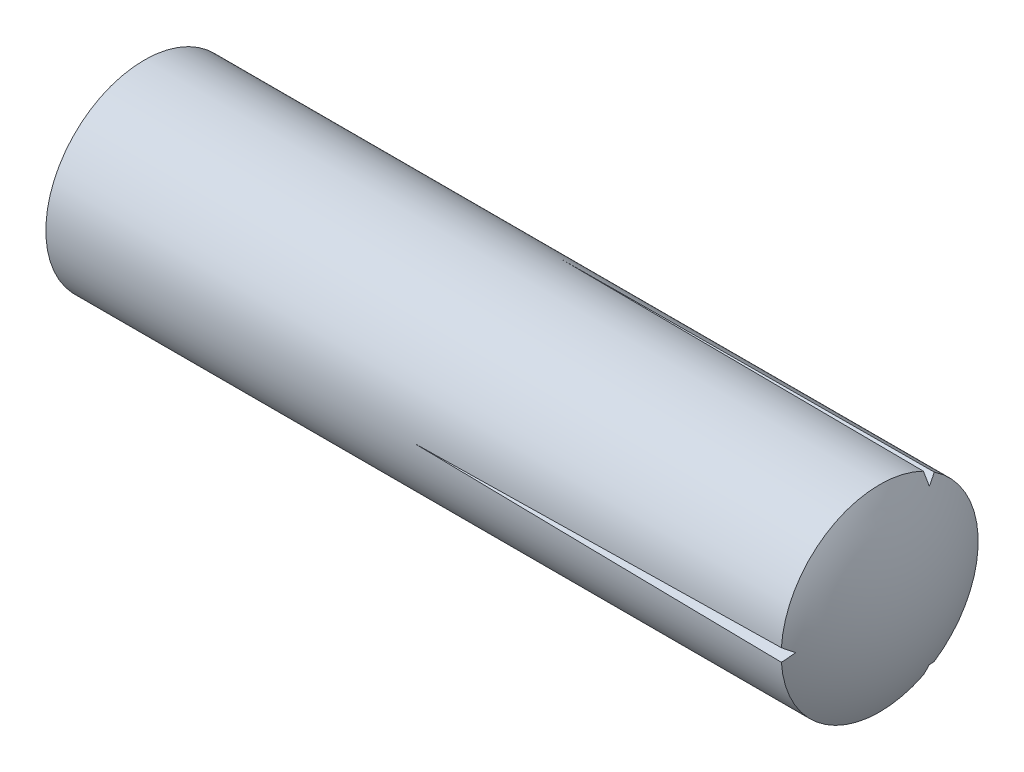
ISO-10303-21;
HEADER;
FILE_DESCRIPTION(('STEP AP214'),'2;1');
FILE_NAME('part.step','',(''),(''),'','','');
FILE_SCHEMA(('AUTOMOTIVE_DESIGN { 1 0 10303 214 1 1 1 1 }'));
ENDSEC;
DATA;
#1=APPLICATION_CONTEXT('core data for automotive mechanical design processes');
#2=APPLICATION_PROTOCOL_DEFINITION('international standard','automotive_design',2000,#1);
#3=PRODUCT_CONTEXT('',#1,'mechanical');
#4=PRODUCT('Part','Part','',(#3));
#5=PRODUCT_RELATED_PRODUCT_CATEGORY('part','',(#4));
#6=PRODUCT_DEFINITION_FORMATION('','',#4);
#7=PRODUCT_DEFINITION_CONTEXT('part definition',#1,'design');
#8=PRODUCT_DEFINITION('design','',#6,#7);
#9=PRODUCT_DEFINITION_SHAPE('','',#8);
#10=(LENGTH_UNIT() NAMED_UNIT(*) SI_UNIT(.MILLI.,.METRE.));
#11=(NAMED_UNIT(*) PLANE_ANGLE_UNIT() SI_UNIT($,.RADIAN.));
#12=(NAMED_UNIT(*) SI_UNIT($,.STERADIAN.) SOLID_ANGLE_UNIT());
#13=UNCERTAINTY_MEASURE_WITH_UNIT(LENGTH_MEASURE(1.E-05),#10,'distance_accuracy_value','');
#14=(GEOMETRIC_REPRESENTATION_CONTEXT(3) GLOBAL_UNCERTAINTY_ASSIGNED_CONTEXT((#13)) GLOBAL_UNIT_ASSIGNED_CONTEXT((#10,
#11,#12)) REPRESENTATION_CONTEXT('',''));
#15=CARTESIAN_POINT('',(0.,0.,0.));
#16=DIRECTION('',(0.,0.,1.));
#17=DIRECTION('',(1.,0.,0.));
#18=AXIS2_PLACEMENT_3D('',#15,#16,#17);
#19=CARTESIAN_POINT('',(-25.,0.,0.));
#20=DIRECTION('',(-1.,0.,0.));
#21=DIRECTION('',(0.,1.,0.));
#22=AXIS2_PLACEMENT_3D('',#19,#20,#21);
#23=SPHERICAL_SURFACE('',#22,25.);
#24=CARTESIAN_POINT('',(-24.9023511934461,6.17179285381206,2.87795427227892));
#25=DIRECTION('',(-0.0143379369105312,-0.906214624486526,-0.422574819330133));
#26=DIRECTION('',(0.,0.422618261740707,-0.906307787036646));
#27=AXIS2_PLACEMENT_3D('',#24,#25,#26);
#28=CIRCLE('',#27,24.0544552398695);
#29=CARTESIAN_POINT('',(-3.34936490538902,10.4038239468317,-6.92895715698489));
#30=VERTEX_POINT('',#29);
#31=CARTESIAN_POINT('',(-2.70853608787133,9.80142731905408,-5.65885670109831));
#32=VERTEX_POINT('',#31);
#33=EDGE_CURVE('E47',#30,#32,#28,.T.);
#34=ORIENTED_EDGE('',*,*,#33,.T.);
#35=CARTESIAN_POINT('',(-24.9023511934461,0.593514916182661,-6.78390653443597));
#36=DIRECTION('',(-0.0143379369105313,-0.0871467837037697,0.996092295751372));
#37=DIRECTION('',(0.,-0.996194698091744,-0.0871557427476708));
#38=AXIS2_PLACEMENT_3D('',#35,#36,#37);
#39=CIRCLE('',#38,24.0544552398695);
#40=CARTESIAN_POINT('',(-3.34936490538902,11.2025648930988,-5.54549725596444));
#41=VERTEX_POINT('',#40);
#42=EDGE_CURVE('E93',#32,#41,#39,.T.);
#43=ORIENTED_EDGE('',*,*,#42,.T.);
#44=CARTESIAN_POINT('',(-3.34936490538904,0.,0.));
#45=DIRECTION('',(-1.,0.,0.));
#46=DIRECTION('',(0.,0.,1.));
#47=AXIS2_PLACEMENT_3D('',#44,#45,#46);
#48=CIRCLE('',#47,12.5);
#49=CARTESIAN_POINT('',(-3.34936490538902,0.798740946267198,12.4744544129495));
#50=VERTEX_POINT('',#49);
#51=EDGE_CURVE('E100',#50,#41,#48,.T.);
#52=ORIENTED_EDGE('',*,*,#51,.F.);
#53=CARTESIAN_POINT('',(-24.9023511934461,-5.5782779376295,3.90595226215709));
#54=DIRECTION('',(-0.0143379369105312,0.819067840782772,-0.573517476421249));
#55=DIRECTION('',(0.,0.573576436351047,0.819152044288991));
#56=AXIS2_PLACEMENT_3D('',#53,#54,#55);
#57=CIRCLE('',#56,24.0544552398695);
#58=CARTESIAN_POINT('',(-2.70853608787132,0.,11.3177134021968));
#59=VERTEX_POINT('',#58);
#60=EDGE_CURVE('E124',#50,#59,#57,.T.);
#61=ORIENTED_EDGE('',*,*,#60,.T.);
#62=CARTESIAN_POINT('',(-24.9023511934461,5.5782779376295,3.90595226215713));
#63=DIRECTION('',(-0.0143379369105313,-0.819067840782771,-0.57351747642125));
#64=DIRECTION('',(0.,0.573576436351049,-0.81915204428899));
#65=AXIS2_PLACEMENT_3D('',#62,#63,#64);
#66=CIRCLE('',#65,24.0544552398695);
#67=CARTESIAN_POINT('',(-3.34936490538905,-0.798740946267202,12.4744544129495));
#68=VERTEX_POINT('',#67);
#69=EDGE_CURVE('E119',#59,#68,#66,.T.);
#70=ORIENTED_EDGE('',*,*,#69,.T.);
#71=CARTESIAN_POINT('',(-3.34936490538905,-11.2025648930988,-5.54549725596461));
#72=VERTEX_POINT('',#71);
#73=EDGE_CURVE('E107',#72,#68,#48,.T.);
#74=ORIENTED_EDGE('',*,*,#73,.F.);
#75=CARTESIAN_POINT('',(-24.9023511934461,-0.593514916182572,-6.78390653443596));
#76=DIRECTION('',(-0.0143379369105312,0.0871467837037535,0.996092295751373));
#77=DIRECTION('',(0.,-0.996194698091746,0.0871557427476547));
#78=AXIS2_PLACEMENT_3D('',#75,#76,#77);
#79=CIRCLE('',#78,24.0544552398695);
#80=CARTESIAN_POINT('',(-2.70853608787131,-9.801427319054,-5.65885670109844));
#81=VERTEX_POINT('',#80);
#82=EDGE_CURVE('E55',#72,#81,#79,.T.);
#83=ORIENTED_EDGE('',*,*,#82,.T.);
#84=CARTESIAN_POINT('',(-24.9023511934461,-6.17179285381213,2.87795427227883));
#85=DIRECTION('',(-0.0143379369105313,0.906214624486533,-0.422574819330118));
#86=DIRECTION('',(0.,0.422618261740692,0.906307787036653));
#87=AXIS2_PLACEMENT_3D('',#84,#85,#86);
#88=CIRCLE('',#87,24.0544552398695);
#89=CARTESIAN_POINT('',(-3.34936490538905,-10.4038239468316,-6.92895715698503));
#90=VERTEX_POINT('',#89);
#91=EDGE_CURVE('E129',#81,#90,#88,.T.);
#92=ORIENTED_EDGE('',*,*,#91,.T.);
#93=EDGE_CURVE('E105',#30,#90,#48,.T.);
#94=ORIENTED_EDGE('',*,*,#93,.F.);
#95=EDGE_LOOP('',(#34,#43,#52,#61,#70,#74,#83,#92,#94));
#96=FACE_BOUND('',#95,.T.);
#97=ADVANCED_FACE('F33',(#96),#23,.T.);
#98=CARTESIAN_POINT('',(-40.,0.,0.));
#99=DIRECTION('',(-1.,0.,0.));
#100=DIRECTION('',(0.,0.,1.));
#101=AXIS2_PLACEMENT_3D('',#98,#99,#100);
#102=CYLINDRICAL_SURFACE('',#101,12.5);
#103=ORIENTED_EDGE('',*,*,#51,.T.);
#104=CARTESIAN_POINT('',(450.,0.,0.));
#105=DIRECTION('',(-0.0143379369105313,-0.0871467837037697,0.996092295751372));
#106=DIRECTION('',(-0.999897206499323,0.0012496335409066,-0.0142833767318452));
#107=AXIS2_PLACEMENT_3D('',#104,#105,#106);
#108=ELLIPSE('',#107,871.813014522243,12.5);
#109=CARTESIAN_POINT('',(-50.,10.8253175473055,-6.2499999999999));
#110=VERTEX_POINT('',#109);
#111=EDGE_CURVE('E11',#41,#110,#108,.T.);
#112=ORIENTED_EDGE('',*,*,#111,.T.);
#113=CARTESIAN_POINT('',(449.999999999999,0.,0.));
#114=DIRECTION('',(-0.0143379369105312,-0.906214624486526,-0.422574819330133));
#115=DIRECTION('',(-0.999897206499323,0.0129945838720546,0.00605947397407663));
#116=AXIS2_PLACEMENT_3D('',#113,#114,#115);
#117=ELLIPSE('',#116,871.813014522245,12.5);
#118=EDGE_CURVE('E40',#110,#30,#117,.T.);
#119=ORIENTED_EDGE('',*,*,#118,.T.);
#120=ORIENTED_EDGE('',*,*,#93,.T.);
#121=CARTESIAN_POINT('',(450.,0.,0.));
#122=DIRECTION('',(-0.0143379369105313,0.906214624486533,-0.422574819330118));
#123=DIRECTION('',(-0.999897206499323,-0.0129945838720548,0.00605947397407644));
#124=AXIS2_PLACEMENT_3D('',#121,#122,#123);
#125=ELLIPSE('',#124,871.813014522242,12.5);
#126=CARTESIAN_POINT('',(-50.,-10.8253175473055,-6.25000000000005));
#127=VERTEX_POINT('',#126);
#128=EDGE_CURVE('E89',#90,#127,#125,.T.);
#129=ORIENTED_EDGE('',*,*,#128,.T.);
#130=CARTESIAN_POINT('',(450.,0.,0.));
#131=DIRECTION('',(-0.0143379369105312,0.0871467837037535,0.996092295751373));
#132=DIRECTION('',(-0.999897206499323,-0.00124963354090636,-0.0142833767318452));
#133=AXIS2_PLACEMENT_3D('',#130,#131,#132);
#134=ELLIPSE('',#133,871.813014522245,12.5);
#135=EDGE_CURVE('E141',#127,#72,#134,.T.);
#136=ORIENTED_EDGE('',*,*,#135,.T.);
#137=ORIENTED_EDGE('',*,*,#73,.T.);
#138=CARTESIAN_POINT('',(450.,0.,0.));
#139=DIRECTION('',(-0.0143379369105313,-0.819067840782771,-0.57351747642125));
#140=DIRECTION('',(-0.999897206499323,0.0117449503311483,0.00822390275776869));
#141=AXIS2_PLACEMENT_3D('',#138,#139,#140);
#142=ELLIPSE('',#141,871.813014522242,12.5);
#143=CARTESIAN_POINT('',(-50.,0.,12.5));
#144=VERTEX_POINT('',#143);
#145=EDGE_CURVE('E108',#68,#144,#142,.T.);
#146=ORIENTED_EDGE('',*,*,#145,.T.);
#147=CARTESIAN_POINT('',(450.,0.,0.));
#148=DIRECTION('',(-0.0143379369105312,0.819067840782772,-0.573517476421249));
#149=DIRECTION('',(-0.999897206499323,-0.0117449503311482,0.00822390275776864));
#150=AXIS2_PLACEMENT_3D('',#147,#148,#149);
#151=ELLIPSE('',#150,871.813014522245,12.5);
#152=EDGE_CURVE('E102',#144,#50,#151,.T.);
#153=ORIENTED_EDGE('',*,*,#152,.T.);
#154=EDGE_LOOP('',(#103,#112,#119,#120,#129,#136,#137,#146,#153));
#155=FACE_BOUND('',#154,.T.);
#156=CARTESIAN_POINT('',(-96.6819046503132,0.,0.));
#157=DIRECTION('',(-1.,0.,0.));
#158=DIRECTION('',(0.,0.,1.));
#159=AXIS2_PLACEMENT_3D('',#156,#157,#158);
#160=CIRCLE('',#159,12.5);
#161=CARTESIAN_POINT('',(-96.6819046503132,12.5,0.));
#162=VERTEX_POINT('',#161);
#163=EDGE_CURVE('E111',#162,#162,#160,.T.);
#164=ORIENTED_EDGE('',*,*,#163,.F.);
#165=EDGE_LOOP('',(#164));
#166=FACE_BOUND('',#165,.T.);
#167=ADVANCED_FACE('F96',(#155,#166),#102,.T.);
#168=CARTESIAN_POINT('',(-75.0312695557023,0.,0.));
#169=DIRECTION('',(-1.,0.,0.));
#170=DIRECTION('',(0.,1.,0.));
#171=AXIS2_PLACEMENT_3D('',#168,#169,#170);
#172=SPHERICAL_SURFACE('',#171,25.);
#173=CARTESIAN_POINT('',(-100.,0.,0.));
#174=DIRECTION('',(-1.,0.,0.));
#175=DIRECTION('',(0.,0.,1.));
#176=AXIS2_PLACEMENT_3D('',#173,#174,#175);
#177=CIRCLE('',#176,1.25);
#178=CARTESIAN_POINT('',(-100.,1.25000000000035,0.));
#179=VERTEX_POINT('',#178);
#180=EDGE_CURVE('E115',#179,#179,#177,.T.);
#181=CARTESIAN_POINT('',(-100.,1.25000000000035,0.));
#182=CARTESIAN_POINT('',(-99.9938336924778,1.37317333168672,0.));
#183=CARTESIAN_POINT('',(-99.9867558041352,1.4963010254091,0.));
#184=CARTESIAN_POINT('',(-99.9707787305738,1.74243819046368,0.));
#185=CARTESIAN_POINT('',(-99.9618795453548,1.86544766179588,0.));
#186=CARTESIAN_POINT('',(-99.942261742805,2.11132143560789,0.));
#187=CARTESIAN_POINT('',(-99.931543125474,2.23418573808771,0.));
#188=CARTESIAN_POINT('',(-99.9082888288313,2.47974226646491,0.));
#189=CARTESIAN_POINT('',(-99.8957531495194,2.60243449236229,0.));
#190=CARTESIAN_POINT('',(-99.8688674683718,2.84761999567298,0.));
#191=CARTESIAN_POINT('',(-99.854517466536,2.9701132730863,0.));
#192=CARTESIAN_POINT('',(-99.8240062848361,3.2148740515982,0.));
#193=CARTESIAN_POINT('',(-99.8078451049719,3.33714155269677,0.));
#194=CARTESIAN_POINT('',(-99.7737151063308,3.58142400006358,0.));
#195=CARTESIAN_POINT('',(-99.7557462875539,3.7034389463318,0.));
#196=CARTESIAN_POINT('',(-99.718004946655,3.94718956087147,0.));
#197=CARTESIAN_POINT('',(-99.698232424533,4.06892522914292,0.));
#198=CARTESIAN_POINT('',(-99.6568880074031,4.31209062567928,0.));
#199=CARTESIAN_POINT('',(-99.6353161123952,4.43352035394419,0.));
#200=CARTESIAN_POINT('',(-99.5903776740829,4.67604727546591,0.));
#201=CARTESIAN_POINT('',(-99.5670111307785,4.79714446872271,0.));
#202=CARTESIAN_POINT('',(-99.5184885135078,5.0389797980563,0.));
#203=CARTESIAN_POINT('',(-99.4933324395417,5.15971793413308,0.));
#204=CARTESIAN_POINT('',(-99.4412362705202,5.40080870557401,0.));
#205=CARTESIAN_POINT('',(-99.4142961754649,5.52116134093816,0.));
#206=CARTESIAN_POINT('',(-99.3586378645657,5.76145475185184,0.));
#207=CARTESIAN_POINT('',(-99.3299196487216,5.88139552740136,0.));
#208=CARTESIAN_POINT('',(-99.2707113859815,6.1208389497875,0.));
#209=CARTESIAN_POINT('',(-99.2402213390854,6.24034159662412,0.));
#210=CARTESIAN_POINT('',(-99.1774760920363,6.4788825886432,0.));
#211=CARTESIAN_POINT('',(-99.1452208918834,6.59792093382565,0.));
#212=CARTESIAN_POINT('',(-99.078952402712,6.83550725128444,0.));
#213=CARTESIAN_POINT('',(-99.0449391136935,6.95405522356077,0.));
#214=CARTESIAN_POINT('',(-98.9751618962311,7.19063483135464,0.));
#215=CARTESIAN_POINT('',(-98.9393979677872,7.30866646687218,0.));
#216=CARTESIAN_POINT('',(-98.8661273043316,7.54418755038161,0.));
#217=CARTESIAN_POINT('',(-98.8286205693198,7.6616769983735,0.));
#218=CARTESIAN_POINT('',(-98.7518725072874,7.89608797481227,0.));
#219=CARTESIAN_POINT('',(-98.7126311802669,8.01300950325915,0.));
#220=CARTESIAN_POINT('',(-98.6324225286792,8.24625903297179,0.));
#221=CARTESIAN_POINT('',(-98.5914552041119,8.36258703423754,0.));
#222=CARTESIAN_POINT('',(-98.5078035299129,8.59462403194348,0.));
#223=CARTESIAN_POINT('',(-98.4651191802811,8.71033302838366,0.));
#224=CARTESIAN_POINT('',(-98.3780428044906,8.94110667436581,0.));
#225=CARTESIAN_POINT('',(-98.3336507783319,9.05617132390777,0.));
#226=CARTESIAN_POINT('',(-98.2431687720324,9.28563107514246,0.));
#227=CARTESIAN_POINT('',(-98.1970787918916,9.40002617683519,0.));
#228=CARTESIAN_POINT('',(-98.1032109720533,9.62812177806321,0.));
#229=CARTESIAN_POINT('',(-98.055433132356,9.74182227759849,0.));
#230=CARTESIAN_POINT('',(-97.9582000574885,9.96850377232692,0.));
#231=CARTESIAN_POINT('',(-97.9087448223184,10.0814847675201,0.));
#232=CARTESIAN_POINT('',(-97.8081677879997,10.3067025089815,0.));
#233=CARTESIAN_POINT('',(-97.7570459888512,10.4189392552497,0.));
#234=CARTESIAN_POINT('',(-97.653147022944,10.6426439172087,0.));
#235=CARTESIAN_POINT('',(-97.6003698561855,10.7541118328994,0.));
#236=CARTESIAN_POINT('',(-97.4931717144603,10.9762544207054,0.));
#237=CARTESIAN_POINT('',(-97.4387507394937,11.0869290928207,0.));
#238=CARTESIAN_POINT('',(-97.3282768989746,11.307460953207,0.));
#239=CARTESIAN_POINT('',(-97.272224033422,11.417318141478,0.));
#240=CARTESIAN_POINT('',(-97.1584986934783,11.6361909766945,0.));
#241=CARTESIAN_POINT('',(-97.1008262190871,11.74520662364,0.));
#242=CARTESIAN_POINT('',(-96.9838742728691,11.9623724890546,0.));
#243=CARTESIAN_POINT('',(-96.9245948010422,12.0705227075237,0.));
#244=CARTESIAN_POINT('',(-96.8044419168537,12.2859340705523,0.));
#245=CARTESIAN_POINT('',(-96.743568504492,12.3931952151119,0.));
#246=CARTESIAN_POINT('',(-96.6819046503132,12.5,0.));
#247=B_SPLINE_CURVE_WITH_KNOTS('',3,(#181,#182,#183,#184,#185,#186,#187,#188,#189,#190,#191,
#192,#193,#194,#195,#196,#197,#198,#199,#200,#201,#202,#203,#204,#205,#206,#207,#208,#209,#210,
#211,#212,#213,#214,#215,#216,#217,#218,#219,#220,#221,#222,#223,#224,#225,#226,#227,#228,#229,
#230,#231,#232,#233,#234,#235,#236,#237,#238,#239,#240,#241,#242,#243,#244,#245,#246),
.UNSPECIFIED.,.F.,.F.,(4,2,2,2,2,2,2,2,2,2,2,2,2,2,2,2,2,2,2,2,2,2,2,2,2,2,2,2,2,2,2,2,4),(0.,
0.369979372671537,0.739958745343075,1.10993811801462,1.47991749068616,1.84989686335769,
2.21987623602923,2.58985560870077,2.95983498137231,3.32981435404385,3.69979372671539,
4.06977309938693,4.43975247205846,4.80973184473,5.17971121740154,5.54969059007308,
5.91966996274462,6.28964933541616,6.6596287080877,7.02960808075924,7.39958745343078,
7.76956682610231,8.13954619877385,8.50952557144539,8.87950494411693,9.24948431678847,
9.61946368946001,9.98944306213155,10.3594224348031,10.7294018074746,11.0993811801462,
11.4693605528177,11.8393399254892),.UNSPECIFIED.);
#248=EDGE_CURVE('BSEAM164',#179,#162,#247,.T.);
#249=ORIENTED_EDGE('',*,*,#180,.F.);
#250=ORIENTED_EDGE('',*,*,#163,.T.);
#251=ORIENTED_EDGE('',*,*,#248,.T.);
#252=ORIENTED_EDGE('',*,*,#248,.F.);
#253=EDGE_LOOP('',(#249,#251,#250,#252));
#254=FACE_BOUND('',#253,.T.);
#255=ADVANCED_FACE('F164',(#254),#172,.T.);
#256=CARTESIAN_POINT('',(-100.,0.,0.));
#257=DIRECTION('',(1.,0.,0.));
#258=DIRECTION('',(0.,0.,-1.));
#259=AXIS2_PLACEMENT_3D('',#256,#257,#258);
#260=PLANE('',#259);
#261=ORIENTED_EDGE('',*,*,#180,.T.);
#262=EDGE_LOOP('',(#261));
#263=FACE_BOUND('',#262,.T.);
#264=ADVANCED_FACE('F158',(#263),#260,.F.);
#265=CARTESIAN_POINT('',(-50.,0.,12.5));
#266=DIRECTION('',(-0.0143379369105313,-0.819067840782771,-0.57351747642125));
#267=DIRECTION('',(0.,0.573576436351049,-0.81915204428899));
#268=AXIS2_PLACEMENT_3D('',#265,#266,#267);
#269=PLANE('',#268);
#270=DIRECTION('',(0.999687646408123,0.,-0.0249921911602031));
#271=VECTOR('',#270,1.);
#272=CARTESIAN_POINT('',(-50.,0.,12.5));
#273=LINE('',#272,#271);
#274=EDGE_CURVE('E126',#144,#59,#273,.T.);
#275=ORIENTED_EDGE('',*,*,#274,.F.);
#276=ORIENTED_EDGE('',*,*,#145,.F.);
#277=ORIENTED_EDGE('',*,*,#69,.F.);
#278=EDGE_LOOP('',(#275,#276,#277));
#279=FACE_BOUND('',#278,.T.);
#280=ADVANCED_FACE('F147',(#279),#269,.F.);
#281=CARTESIAN_POINT('',(-50.,0.,12.5));
#282=DIRECTION('',(-0.0143379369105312,0.819067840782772,-0.573517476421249));
#283=DIRECTION('',(0.,0.573576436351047,0.819152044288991));
#284=AXIS2_PLACEMENT_3D('',#281,#282,#283);
#285=PLANE('',#284);
#286=ORIENTED_EDGE('',*,*,#152,.F.);
#287=ORIENTED_EDGE('',*,*,#274,.T.);
#288=ORIENTED_EDGE('',*,*,#60,.F.);
#289=EDGE_LOOP('',(#286,#287,#288));
#290=FACE_BOUND('',#289,.T.);
#291=ADVANCED_FACE('F149',(#290),#285,.F.);
#292=CARTESIAN_POINT('',(-50.,-10.8253175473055,-6.25000000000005));
#293=DIRECTION('',(-0.0143379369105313,0.906214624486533,-0.422574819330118));
#294=DIRECTION('',(0.,0.422618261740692,0.906307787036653));
#295=AXIS2_PLACEMENT_3D('',#292,#293,#294);
#296=PLANE('',#295);
#297=DIRECTION('',(0.999687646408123,0.0216438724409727,0.0124960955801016));
#298=VECTOR('',#297,1.);
#299=CARTESIAN_POINT('',(-50.,-10.8253175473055,-6.25000000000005));
#300=LINE('',#299,#298);
#301=EDGE_CURVE('E133',#127,#81,#300,.T.);
#302=ORIENTED_EDGE('',*,*,#301,.F.);
#303=ORIENTED_EDGE('',*,*,#128,.F.);
#304=ORIENTED_EDGE('',*,*,#91,.F.);
#305=EDGE_LOOP('',(#302,#303,#304));
#306=FACE_BOUND('',#305,.T.);
#307=ADVANCED_FACE('F140',(#306),#296,.F.);
#308=CARTESIAN_POINT('',(-50.,-10.8253175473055,-6.25000000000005));
#309=DIRECTION('',(-0.0143379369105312,0.0871467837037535,0.996092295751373));
#310=DIRECTION('',(0.,-0.996194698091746,0.0871557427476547));
#311=AXIS2_PLACEMENT_3D('',#308,#309,#310);
#312=PLANE('',#311);
#313=ORIENTED_EDGE('',*,*,#135,.F.);
#314=ORIENTED_EDGE('',*,*,#301,.T.);
#315=ORIENTED_EDGE('',*,*,#82,.F.);
#316=EDGE_LOOP('',(#313,#314,#315));
#317=FACE_BOUND('',#316,.T.);
#318=ADVANCED_FACE('F156',(#317),#312,.F.);
#319=CARTESIAN_POINT('',(-50.,10.8253175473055,-6.2499999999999));
#320=DIRECTION('',(-0.0143379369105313,-0.0871467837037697,0.996092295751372));
#321=DIRECTION('',(0.,-0.996194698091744,-0.0871557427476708));
#322=AXIS2_PLACEMENT_3D('',#319,#320,#321);
#323=PLANE('',#322);
#324=DIRECTION('',(0.999687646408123,-0.0216438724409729,0.0124960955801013));
#325=VECTOR('',#324,1.);
#326=CARTESIAN_POINT('',(-50.,10.8253175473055,-6.2499999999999));
#327=LINE('',#326,#325);
#328=EDGE_CURVE('E86',#110,#32,#327,.T.);
#329=ORIENTED_EDGE('',*,*,#328,.F.);
#330=ORIENTED_EDGE('',*,*,#111,.F.);
#331=ORIENTED_EDGE('',*,*,#42,.F.);
#332=EDGE_LOOP('',(#329,#330,#331));
#333=FACE_BOUND('',#332,.T.);
#334=ADVANCED_FACE('F91',(#333),#323,.F.);
#335=CARTESIAN_POINT('',(-50.,10.8253175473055,-6.2499999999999));
#336=DIRECTION('',(-0.0143379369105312,-0.906214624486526,-0.422574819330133));
#337=DIRECTION('',(0.,0.422618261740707,-0.906307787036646));
#338=AXIS2_PLACEMENT_3D('',#335,#336,#337);
#339=PLANE('',#338);
#340=ORIENTED_EDGE('',*,*,#118,.F.);
#341=ORIENTED_EDGE('',*,*,#328,.T.);
#342=ORIENTED_EDGE('',*,*,#33,.F.);
#343=EDGE_LOOP('',(#340,#341,#342));
#344=FACE_BOUND('',#343,.T.);
#345=ADVANCED_FACE('F85',(#344),#339,.F.);
#346=CLOSED_SHELL('',(#97,#167,#255,#264,#280,#291,#307,#318,#334,#345));
#347=MANIFOLD_SOLID_BREP('B2',#346);
#348=ADVANCED_BREP_SHAPE_REPRESENTATION('',(#18,#347),#14);
#349=SHAPE_DEFINITION_REPRESENTATION(#9,#348);
ENDSEC;
END-ISO-10303-21;
